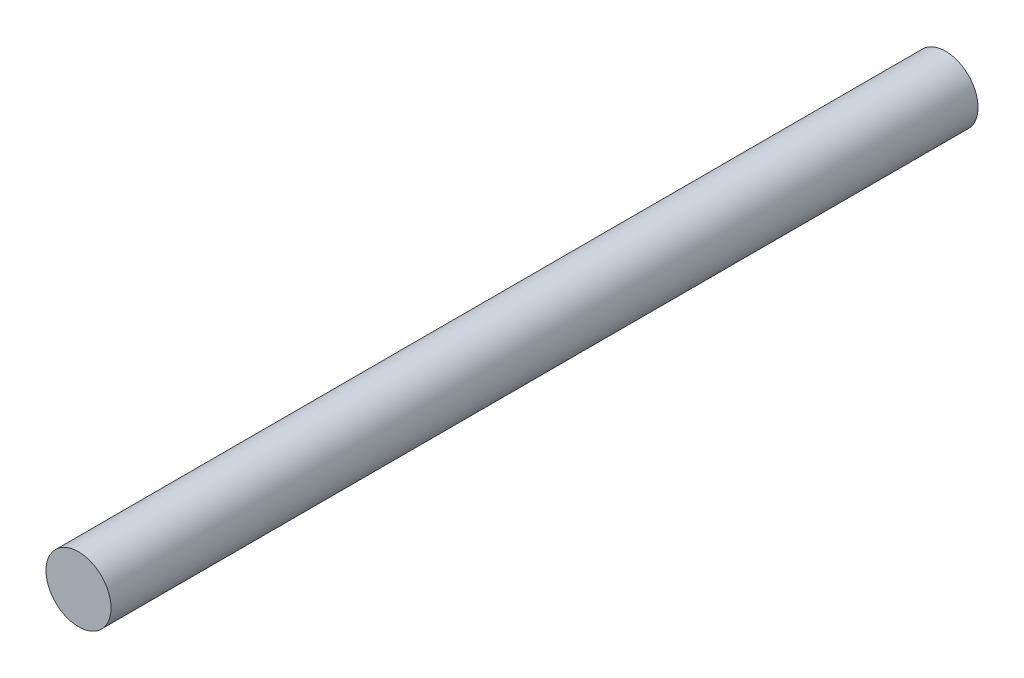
ISO-10303-21;
HEADER;
FILE_DESCRIPTION(('STEP AP214'),'2;1');
FILE_NAME('part.step','',(''),(''),'','','');
FILE_SCHEMA(('AUTOMOTIVE_DESIGN { 1 0 10303 214 1 1 1 1 }'));
ENDSEC;
DATA;
#1=APPLICATION_CONTEXT('core data for automotive mechanical design processes');
#2=APPLICATION_PROTOCOL_DEFINITION('international standard','automotive_design',2000,#1);
#3=PRODUCT_CONTEXT('',#1,'mechanical');
#4=PRODUCT('Part','Part','',(#3));
#5=PRODUCT_RELATED_PRODUCT_CATEGORY('part','',(#4));
#6=PRODUCT_DEFINITION_FORMATION('','',#4);
#7=PRODUCT_DEFINITION_CONTEXT('part definition',#1,'design');
#8=PRODUCT_DEFINITION('design','',#6,#7);
#9=PRODUCT_DEFINITION_SHAPE('','',#8);
#10=(LENGTH_UNIT() NAMED_UNIT(*) SI_UNIT(.MILLI.,.METRE.));
#11=(NAMED_UNIT(*) PLANE_ANGLE_UNIT() SI_UNIT($,.RADIAN.));
#12=(NAMED_UNIT(*) SI_UNIT($,.STERADIAN.) SOLID_ANGLE_UNIT());
#13=UNCERTAINTY_MEASURE_WITH_UNIT(LENGTH_MEASURE(1.E-05),#10,'distance_accuracy_value','');
#14=(GEOMETRIC_REPRESENTATION_CONTEXT(3) GLOBAL_UNCERTAINTY_ASSIGNED_CONTEXT((#13)) GLOBAL_UNIT_ASSIGNED_CONTEXT((#10,
#11,#12)) REPRESENTATION_CONTEXT('',''));
#15=CARTESIAN_POINT('',(0.,0.,0.));
#16=DIRECTION('',(0.,0.,1.));
#17=DIRECTION('',(1.,0.,0.));
#18=AXIS2_PLACEMENT_3D('',#15,#16,#17);
#19=CARTESIAN_POINT('',(0.,0.,320.));
#20=DIRECTION('',(0.,0.,1.));
#21=DIRECTION('',(1.,0.,0.));
#22=AXIS2_PLACEMENT_3D('',#19,#20,#21);
#23=PLANE('',#22);
#24=CARTESIAN_POINT('',(0.,0.,320.));
#25=DIRECTION('',(0.,0.,1.));
#26=DIRECTION('',(1.,0.,0.));
#27=AXIS2_PLACEMENT_3D('',#24,#25,#26);
#28=CIRCLE('',#27,12.);
#29=CARTESIAN_POINT('',(12.,0.,320.));
#30=VERTEX_POINT('',#29);
#31=EDGE_CURVE('E8',#30,#30,#28,.F.);
#32=ORIENTED_EDGE('',*,*,#31,.F.);
#33=EDGE_LOOP('',(#32));
#34=FACE_BOUND('',#33,.T.);
#35=ADVANCED_FACE('F12',(#34),#23,.T.);
#36=CARTESIAN_POINT('',(0.,0.,320.));
#37=DIRECTION('',(0.,0.,-1.));
#38=DIRECTION('',(-1.,0.,0.));
#39=AXIS2_PLACEMENT_3D('',#36,#37,#38);
#40=CYLINDRICAL_SURFACE('',#39,12.);
#41=CARTESIAN_POINT('',(0.,0.,0.));
#42=DIRECTION('',(0.,0.,-1.));
#43=DIRECTION('',(-1.,0.,0.));
#44=AXIS2_PLACEMENT_3D('',#41,#42,#43);
#45=CIRCLE('',#44,12.);
#46=CARTESIAN_POINT('',(-12.,0.,0.));
#47=VERTEX_POINT('',#46);
#48=EDGE_CURVE('E19',#47,#47,#45,.T.);
#49=ORIENTED_EDGE('',*,*,#48,.F.);
#50=EDGE_LOOP('',(#49));
#51=FACE_BOUND('',#50,.T.);
#52=ORIENTED_EDGE('',*,*,#31,.T.);
#53=EDGE_LOOP('',(#52));
#54=FACE_BOUND('',#53,.T.);
#55=ADVANCED_FACE('F14',(#51,#54),#40,.T.);
#56=CARTESIAN_POINT('',(0.,0.,0.));
#57=DIRECTION('',(0.,0.,1.));
#58=DIRECTION('',(1.,0.,0.));
#59=AXIS2_PLACEMENT_3D('',#56,#57,#58);
#60=PLANE('',#59);
#61=ORIENTED_EDGE('',*,*,#48,.T.);
#62=EDGE_LOOP('',(#61));
#63=FACE_BOUND('',#62,.T.);
#64=ADVANCED_FACE('F25',(#63),#60,.F.);
#65=CLOSED_SHELL('',(#35,#55,#64));
#66=MANIFOLD_SOLID_BREP('B1',#65);
#67=ADVANCED_BREP_SHAPE_REPRESENTATION('',(#18,#66),#14);
#68=SHAPE_DEFINITION_REPRESENTATION(#9,#67);
ENDSEC;
END-ISO-10303-21;
